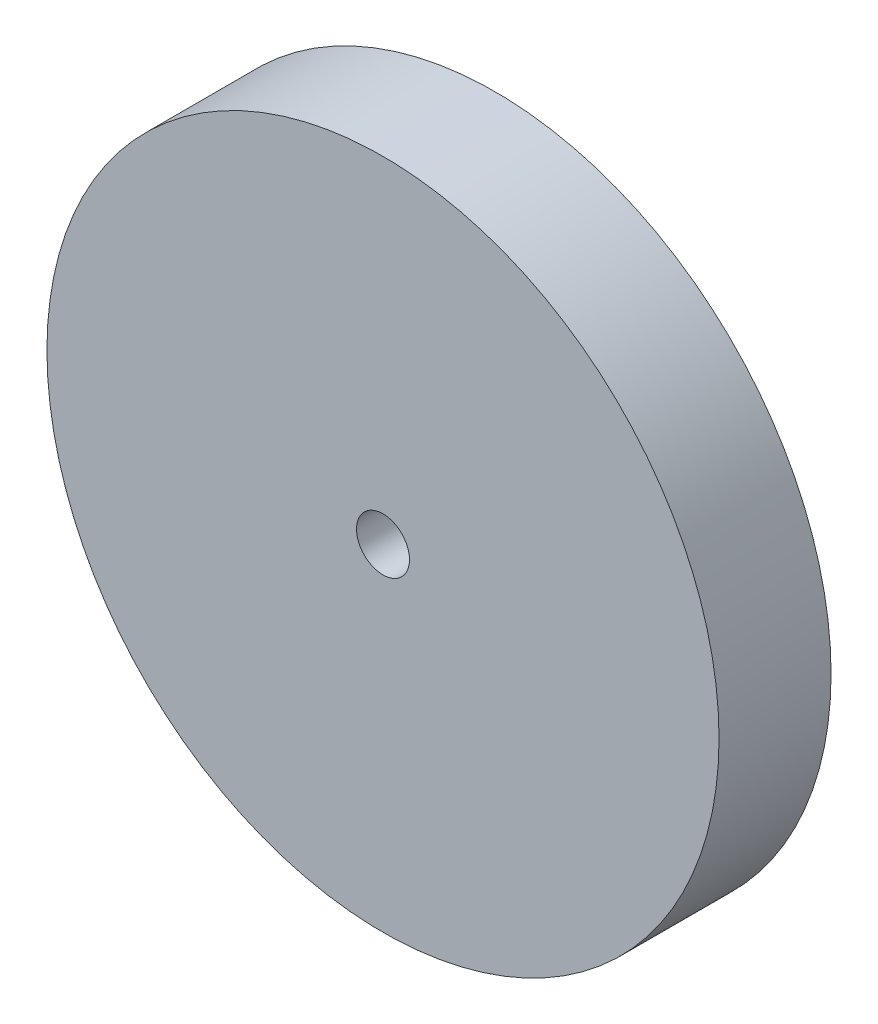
from build123d import *

# Parameters (mm, degrees)
SKETCH1_R           = 38.1
SKETCH1_R_2         = 3
BOSS_EXTRUDE1_DEPTH = 12.7


with BuildPart() as part:
    # Sketch1 → Boss-Extrude1 (new body)
    with BuildSketch(Plane.XY):
        Circle(SKETCH1_R)
        Circle(SKETCH1_R_2, mode=Mode.SUBTRACT)
    extrude(amount=BOSS_EXTRUDE1_DEPTH)


solid = part.part
